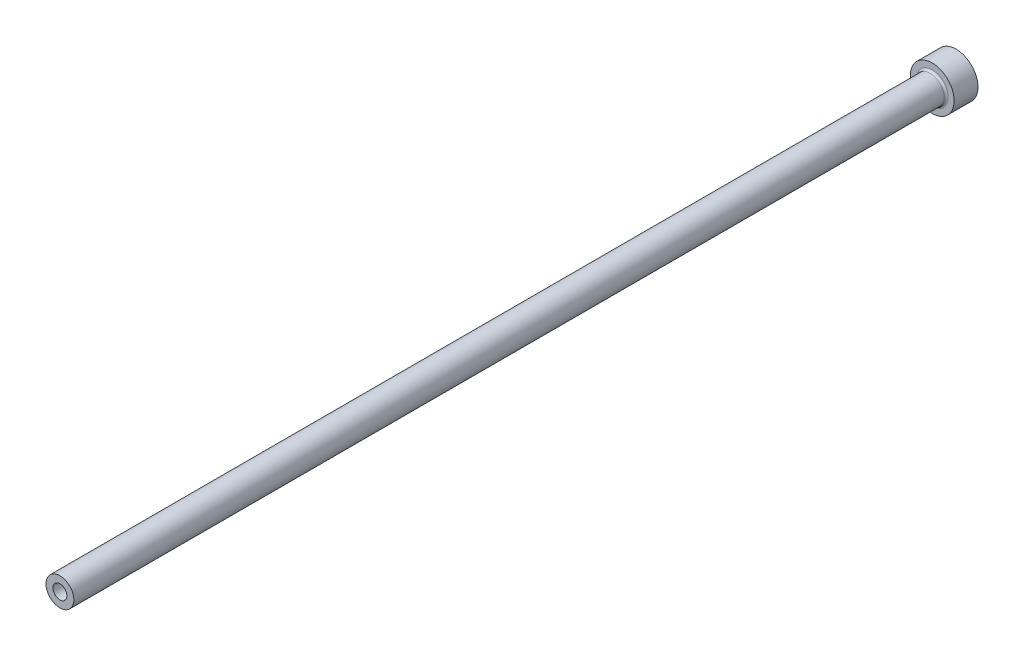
from build123d import *

# Parameters (mm, degrees)
HEAD_FILLET_R          = 0.5
ID_RELIEF_CHAMFER_SIZE = 0.5


with BuildPart() as part:
    # OD FV → Base Revolve (revolve)
    with BuildSketch(Plane(origin=(0, 0, 0), x_dir=(1, 0, 0), z_dir=(0, 1, 0))):
        Polygon((0, -225), (3.5, -225), (3.5, -6), (5.5, -6), (5.5, 0), (0, 0), align=None)
    revolve(axis=Axis((0, 0, 225), (0, 0, -1)))

    # ID FV → Hole (revolve, cut)
    with BuildSketch(Plane(origin=(0, 0, 0), x_dir=(1, 0, 0), z_dir=(0, 1, 0))):
        Polygon((0, -225), (1.75, -225), (1.75, -125), (2, -124.566987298), (2, 0), (0, 0), align=None)
    revolve(axis=Axis((0, 0, 225), (0, 0, -1)), mode=Mode.SUBTRACT)

    # Head Fillet
    head_fillet_edges = [part.edges().sort_by_distance(p)[0] for p in [
        (-3.5, 0, 6),
    ]]
    fillet(head_fillet_edges, radius=HEAD_FILLET_R)

    # ID Relief Chamfer
    id_relief_chamfer_edges = [part.edges().sort_by_distance(p)[0] for p in [
        (-2, 0, 0),
    ]]
    chamfer(id_relief_chamfer_edges, length=ID_RELIEF_CHAMFER_SIZE)


solid = part.part
